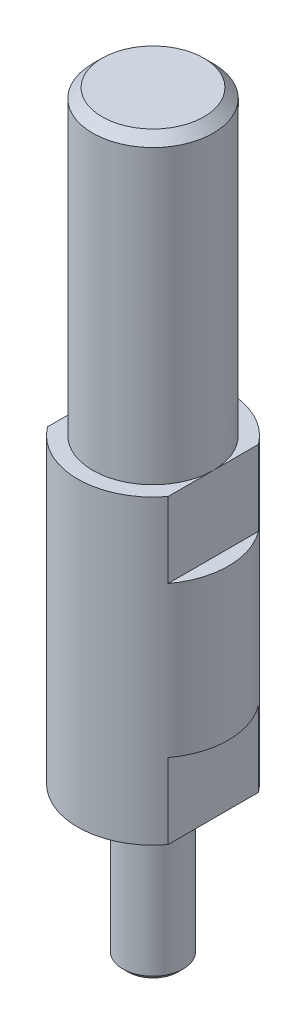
from build123d import *

# Parameters (mm, degrees)
SKETCH2_OUTSIDE_W   = 22.392
SKETCH2_OUTSIDE_H   = 22.392
SKETCH2_OUTSIDE_W_2 = 8
SKETCH2_OUTSIDE_H_2 = 10.7008605
CUT_EXTRUDE1_DEPTH  = 5
SKETCH3_OUTSIDE_W   = 22.392
SKETCH3_OUTSIDE_H   = 22.392
SKETCH3_OUTSIDE_W_2 = 8
SKETCH3_OUTSIDE_H_2 = 10.99403476
CUT_EXTRUDE2_DEPTH  = 5
CHAMFER2_SIZE       = 0.35
CHAMFER3_SIZE       = 0.625


with BuildPart() as part:
    # Sketch1 → Revolve1 (revolve)
    with BuildSketch(Plane.XY):
        Polygon((0, 0), (0, 20), (4, 20), (4, 0), (5, 0), (5, -20), (2, -20), (2, -30), (0, -30), align=None)
    revolve(axis=Axis((0, -30, 0), (0, 1, 0)))

    # Sketch2 outside → Cut-Extrude1 (cut)
    with BuildSketch(Plane.XZ.offset(20)):
        Rectangle(SKETCH2_OUTSIDE_W, SKETCH2_OUTSIDE_H)
        Rectangle(SKETCH2_OUTSIDE_W_2, SKETCH2_OUTSIDE_H_2, mode=Mode.SUBTRACT)
    extrude(amount=-CUT_EXTRUDE1_DEPTH, mode=Mode.SUBTRACT)

    # Sketch3 outside → Cut-Extrude2 (cut)
    with BuildSketch(Plane(origin=(0, 0, 0), x_dir=(1, 0, 0), z_dir=(0, 1, 0))):
        Rectangle(SKETCH3_OUTSIDE_W, SKETCH3_OUTSIDE_H)
        Rectangle(SKETCH3_OUTSIDE_W_2, SKETCH3_OUTSIDE_H_2, mode=Mode.SUBTRACT)
    extrude(amount=-CUT_EXTRUDE2_DEPTH, mode=Mode.SUBTRACT)

    # Chamfer2
    chamfer2_edges = [part.edges().sort_by_distance(p)[0] for p in [
        (-2, -30, 0),
    ]]
    chamfer(chamfer2_edges, length=CHAMFER2_SIZE)

    # Chamfer3
    chamfer3_edges = [part.edges().sort_by_distance(p)[0] for p in [
        (-4, 20, 0),
    ]]
    chamfer(chamfer3_edges, length=CHAMFER3_SIZE)


solid = part.part
